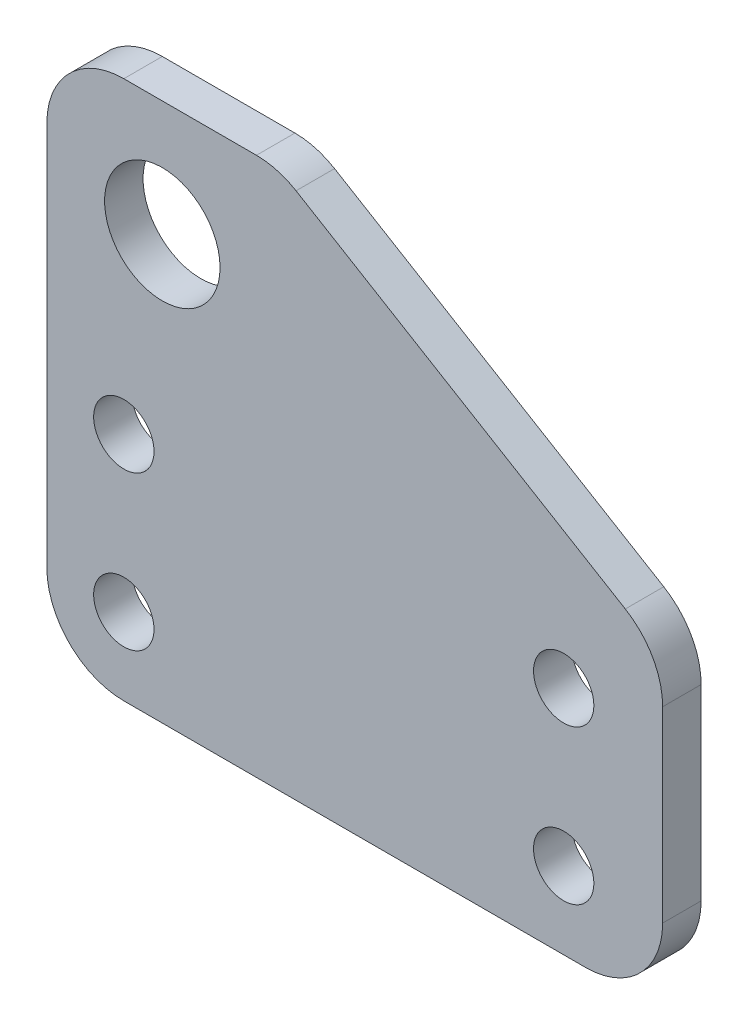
ISO-10303-21;
HEADER;
FILE_DESCRIPTION(('STEP AP214'),'2;1');
FILE_NAME('part.step','',(''),(''),'','','');
FILE_SCHEMA(('AUTOMOTIVE_DESIGN { 1 0 10303 214 1 1 1 1 }'));
ENDSEC;
DATA;
#1=APPLICATION_CONTEXT('core data for automotive mechanical design processes');
#2=APPLICATION_PROTOCOL_DEFINITION('international standard','automotive_design',2000,#1);
#3=PRODUCT_CONTEXT('',#1,'mechanical');
#4=PRODUCT('Part','Part','',(#3));
#5=PRODUCT_RELATED_PRODUCT_CATEGORY('part','',(#4));
#6=PRODUCT_DEFINITION_FORMATION('','',#4);
#7=PRODUCT_DEFINITION_CONTEXT('part definition',#1,'design');
#8=PRODUCT_DEFINITION('design','',#6,#7);
#9=PRODUCT_DEFINITION_SHAPE('','',#8);
#10=(LENGTH_UNIT() NAMED_UNIT(*) SI_UNIT(.MILLI.,.METRE.));
#11=(NAMED_UNIT(*) PLANE_ANGLE_UNIT() SI_UNIT($,.RADIAN.));
#12=(NAMED_UNIT(*) SI_UNIT($,.STERADIAN.) SOLID_ANGLE_UNIT());
#13=UNCERTAINTY_MEASURE_WITH_UNIT(LENGTH_MEASURE(1.E-05),#10,'distance_accuracy_value','');
#14=(GEOMETRIC_REPRESENTATION_CONTEXT(3) GLOBAL_UNCERTAINTY_ASSIGNED_CONTEXT((#13)) GLOBAL_UNIT_ASSIGNED_CONTEXT((#10,
#11,#12)) REPRESENTATION_CONTEXT('',''));
#15=CARTESIAN_POINT('',(0.,0.,0.));
#16=DIRECTION('',(0.,0.,1.));
#17=DIRECTION('',(1.,0.,0.));
#18=AXIS2_PLACEMENT_3D('',#15,#16,#17);
#19=CARTESIAN_POINT('',(0.,0.,3.175));
#20=DIRECTION('',(0.,0.,-1.));
#21=DIRECTION('',(-1.,0.,0.));
#22=AXIS2_PLACEMENT_3D('',#19,#20,#21);
#23=PLANE('',#22);
#24=DIRECTION('',(-1.,0.,0.));
#25=VECTOR('',#24,1.);
#26=CARTESIAN_POINT('',(0.,44.45,3.175));
#27=LINE('',#26,#25);
#28=CARTESIAN_POINT('',(17.2911518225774,44.45,3.175));
#29=VERTEX_POINT('',#28);
#30=CARTESIAN_POINT('',(6.35,44.45,3.175));
#31=VERTEX_POINT('',#30);
#32=EDGE_CURVE('E194',#29,#31,#27,.T.);
#33=ORIENTED_EDGE('',*,*,#32,.T.);
#34=CARTESIAN_POINT('',(6.35,38.1,3.175));
#35=DIRECTION('',(0.,0.,-1.));
#36=DIRECTION('',(-1.,0.,0.));
#37=AXIS2_PLACEMENT_3D('',#34,#35,#36);
#38=CIRCLE('',#37,6.35);
#39=CARTESIAN_POINT('',(0.,38.1,3.175));
#40=VERTEX_POINT('',#39);
#41=EDGE_CURVE('E168',#31,#40,#38,.F.);
#42=ORIENTED_EDGE('',*,*,#41,.T.);
#43=DIRECTION('',(0.,-1.,0.));
#44=VECTOR('',#43,1.);
#45=CARTESIAN_POINT('',(0.,0.,3.175));
#46=LINE('',#45,#44);
#47=CARTESIAN_POINT('',(0.,6.35,3.175));
#48=VERTEX_POINT('',#47);
#49=EDGE_CURVE('E134',#40,#48,#46,.T.);
#50=ORIENTED_EDGE('',*,*,#49,.T.);
#51=CARTESIAN_POINT('',(6.35,6.35,3.175));
#52=DIRECTION('',(0.,0.,-1.));
#53=DIRECTION('',(-1.,0.,0.));
#54=AXIS2_PLACEMENT_3D('',#51,#52,#53);
#55=CIRCLE('',#54,6.35);
#56=CARTESIAN_POINT('',(6.35,0.,3.175));
#57=VERTEX_POINT('',#56);
#58=EDGE_CURVE('E58',#48,#57,#55,.F.);
#59=ORIENTED_EDGE('',*,*,#58,.T.);
#60=DIRECTION('',(1.,0.,0.));
#61=VECTOR('',#60,1.);
#62=CARTESIAN_POINT('',(50.8,0.,3.175));
#63=LINE('',#62,#61);
#64=CARTESIAN_POINT('',(44.45,0.,3.175));
#65=VERTEX_POINT('',#64);
#66=EDGE_CURVE('E150',#57,#65,#63,.T.);
#67=ORIENTED_EDGE('',*,*,#66,.T.);
#68=CARTESIAN_POINT('',(44.45,6.35,3.175));
#69=DIRECTION('',(0.,0.,-1.));
#70=DIRECTION('',(-1.,0.,0.));
#71=AXIS2_PLACEMENT_3D('',#68,#69,#70);
#72=CIRCLE('',#71,6.35);
#73=CARTESIAN_POINT('',(50.8,6.35,3.175));
#74=VERTEX_POINT('',#73);
#75=EDGE_CURVE('E165',#65,#74,#72,.F.);
#76=ORIENTED_EDGE('',*,*,#75,.T.);
#77=DIRECTION('',(0.,1.,0.));
#78=VECTOR('',#77,1.);
#79=CARTESIAN_POINT('',(50.8,0.,3.175));
#80=LINE('',#79,#78);
#81=CARTESIAN_POINT('',(50.8,21.8046910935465,3.175));
#82=VERTEX_POINT('',#81);
#83=EDGE_CURVE('E144',#74,#82,#80,.T.);
#84=ORIENTED_EDGE('',*,*,#83,.T.);
#85=CARTESIAN_POINT('',(44.45,21.8046910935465,3.175));
#86=DIRECTION('',(0.,0.,-1.));
#87=DIRECTION('',(-1.,0.,0.));
#88=AXIS2_PLACEMENT_3D('',#85,#86,#87);
#89=CIRCLE('',#88,6.35);
#90=CARTESIAN_POINT('',(47.7170480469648,27.2497711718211,3.175));
#91=VERTEX_POINT('',#90);
#92=EDGE_CURVE('E163',#82,#91,#89,.F.);
#93=ORIENTED_EDGE('',*,*,#92,.T.);
#94=DIRECTION('',(-0.857492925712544,0.514495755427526,0.));
#95=VECTOR('',#94,1.);
#96=CARTESIAN_POINT('',(50.8,25.4,3.175));
#97=LINE('',#96,#95);
#98=CARTESIAN_POINT('',(20.5581998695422,43.5450800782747,3.175));
#99=VERTEX_POINT('',#98);
#100=EDGE_CURVE('E184',#91,#99,#97,.T.);
#101=ORIENTED_EDGE('',*,*,#100,.T.);
#102=CARTESIAN_POINT('',(17.2911518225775,38.1,3.175));
#103=DIRECTION('',(0.,0.,-1.));
#104=DIRECTION('',(-1.,0.,0.));
#105=AXIS2_PLACEMENT_3D('',#102,#103,#104);
#106=CIRCLE('',#105,6.35);
#107=EDGE_CURVE('E161',#99,#29,#106,.F.);
#108=ORIENTED_EDGE('',*,*,#107,.T.);
#109=EDGE_LOOP('',(#33,#42,#50,#59,#67,#76,#84,#93,#101,#108));
#110=FACE_BOUND('',#109,.T.);
#111=CARTESIAN_POINT('',(6.34999999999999,19.05,3.175));
#112=DIRECTION('',(0.,0.,1.));
#113=DIRECTION('',(1.,0.,0.));
#114=AXIS2_PLACEMENT_3D('',#111,#112,#113);
#115=CIRCLE('',#114,2.4892);
#116=CARTESIAN_POINT('',(8.83919999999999,19.05,3.175));
#117=VERTEX_POINT('',#116);
#118=EDGE_CURVE('E202',#117,#117,#115,.T.);
#119=ORIENTED_EDGE('',*,*,#118,.F.);
#120=EDGE_LOOP('',(#119));
#121=FACE_BOUND('',#120,.T.);
#122=CARTESIAN_POINT('',(42.6357142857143,19.05,3.175));
#123=DIRECTION('',(0.,0.,1.));
#124=DIRECTION('',(1.,0.,0.));
#125=AXIS2_PLACEMENT_3D('',#122,#123,#124);
#126=CIRCLE('',#125,2.4892);
#127=CARTESIAN_POINT('',(45.1249142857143,19.05,3.175));
#128=VERTEX_POINT('',#127);
#129=EDGE_CURVE('E212',#128,#128,#126,.T.);
#130=ORIENTED_EDGE('',*,*,#129,.F.);
#131=EDGE_LOOP('',(#130));
#132=FACE_BOUND('',#131,.T.);
#133=CARTESIAN_POINT('',(42.6357142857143,6.35000000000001,3.175));
#134=DIRECTION('',(0.,0.,1.));
#135=DIRECTION('',(1.,0.,0.));
#136=AXIS2_PLACEMENT_3D('',#133,#134,#135);
#137=CIRCLE('',#136,2.4892);
#138=CARTESIAN_POINT('',(45.1249142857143,6.35000000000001,3.175));
#139=VERTEX_POINT('',#138);
#140=EDGE_CURVE('E218',#139,#139,#137,.T.);
#141=ORIENTED_EDGE('',*,*,#140,.F.);
#142=EDGE_LOOP('',(#141));
#143=FACE_BOUND('',#142,.T.);
#144=CARTESIAN_POINT('',(6.35,6.34999999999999,3.175));
#145=DIRECTION('',(0.,0.,1.));
#146=DIRECTION('',(1.,0.,0.));
#147=AXIS2_PLACEMENT_3D('',#144,#145,#146);
#148=CIRCLE('',#147,2.4892);
#149=CARTESIAN_POINT('',(8.8392,6.34999999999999,3.175));
#150=VERTEX_POINT('',#149);
#151=EDGE_CURVE('E224',#150,#150,#148,.T.);
#152=ORIENTED_EDGE('',*,*,#151,.F.);
#153=EDGE_LOOP('',(#152));
#154=FACE_BOUND('',#153,.T.);
#155=CARTESIAN_POINT('',(9.525,34.925,3.175));
#156=DIRECTION('',(0.,0.,1.));
#157=DIRECTION('',(1.,0.,0.));
#158=AXIS2_PLACEMENT_3D('',#155,#156,#157);
#159=CIRCLE('',#158,4.7625);
#160=CARTESIAN_POINT('',(14.2875,34.925,3.175));
#161=VERTEX_POINT('',#160);
#162=EDGE_CURVE('E230',#161,#161,#159,.T.);
#163=ORIENTED_EDGE('',*,*,#162,.F.);
#164=EDGE_LOOP('',(#163));
#165=FACE_BOUND('',#164,.T.);
#166=ADVANCED_FACE('F36',(#110,#121,#132,#143,#154,#165),#23,.F.);
#167=CARTESIAN_POINT('',(0.,0.,0.));
#168=DIRECTION('',(0.,0.,-1.));
#169=DIRECTION('',(-1.,0.,0.));
#170=AXIS2_PLACEMENT_3D('',#167,#168,#169);
#171=PLANE('',#170);
#172=CARTESIAN_POINT('',(6.35,6.34999999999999,0.));
#173=DIRECTION('',(0.,0.,1.));
#174=DIRECTION('',(1.,0.,0.));
#175=AXIS2_PLACEMENT_3D('',#172,#173,#174);
#176=CIRCLE('',#175,2.4892);
#177=CARTESIAN_POINT('',(8.8392,6.34999999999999,0.));
#178=VERTEX_POINT('',#177);
#179=EDGE_CURVE('E227',#178,#178,#176,.T.);
#180=ORIENTED_EDGE('',*,*,#179,.T.);
#181=EDGE_LOOP('',(#180));
#182=FACE_BOUND('',#181,.T.);
#183=CARTESIAN_POINT('',(42.6357142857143,19.05,0.));
#184=DIRECTION('',(0.,0.,1.));
#185=DIRECTION('',(1.,0.,0.));
#186=AXIS2_PLACEMENT_3D('',#183,#184,#185);
#187=CIRCLE('',#186,2.4892);
#188=CARTESIAN_POINT('',(45.1249142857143,19.05,0.));
#189=VERTEX_POINT('',#188);
#190=EDGE_CURVE('E215',#189,#189,#187,.T.);
#191=ORIENTED_EDGE('',*,*,#190,.T.);
#192=EDGE_LOOP('',(#191));
#193=FACE_BOUND('',#192,.T.);
#194=DIRECTION('',(0.,-1.,0.));
#195=VECTOR('',#194,1.);
#196=CARTESIAN_POINT('',(0.,0.,0.));
#197=LINE('',#196,#195);
#198=CARTESIAN_POINT('',(0.,38.1,0.));
#199=VERTEX_POINT('',#198);
#200=CARTESIAN_POINT('',(0.,6.35,0.));
#201=VERTEX_POINT('',#200);
#202=EDGE_CURVE('E132',#199,#201,#197,.T.);
#203=ORIENTED_EDGE('',*,*,#202,.F.);
#204=CARTESIAN_POINT('',(6.35,38.1,0.));
#205=DIRECTION('',(0.,0.,-1.));
#206=DIRECTION('',(-1.,0.,0.));
#207=AXIS2_PLACEMENT_3D('',#204,#205,#206);
#208=CIRCLE('',#207,6.35);
#209=CARTESIAN_POINT('',(6.35,44.45,0.));
#210=VERTEX_POINT('',#209);
#211=EDGE_CURVE('E115',#199,#210,#208,.T.);
#212=ORIENTED_EDGE('',*,*,#211,.T.);
#213=DIRECTION('',(-1.,0.,0.));
#214=VECTOR('',#213,1.);
#215=CARTESIAN_POINT('',(0.,44.45,0.));
#216=LINE('',#215,#214);
#217=CARTESIAN_POINT('',(17.2911518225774,44.45,0.));
#218=VERTEX_POINT('',#217);
#219=EDGE_CURVE('E142',#218,#210,#216,.T.);
#220=ORIENTED_EDGE('',*,*,#219,.F.);
#221=CARTESIAN_POINT('',(17.2911518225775,38.1,0.));
#222=DIRECTION('',(0.,0.,-1.));
#223=DIRECTION('',(-1.,0.,0.));
#224=AXIS2_PLACEMENT_3D('',#221,#222,#223);
#225=CIRCLE('',#224,6.35);
#226=CARTESIAN_POINT('',(20.5581998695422,43.5450800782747,0.));
#227=VERTEX_POINT('',#226);
#228=EDGE_CURVE('E135',#218,#227,#225,.T.);
#229=ORIENTED_EDGE('',*,*,#228,.T.);
#230=DIRECTION('',(-0.857492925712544,0.514495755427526,0.));
#231=VECTOR('',#230,1.);
#232=CARTESIAN_POINT('',(50.8,25.4,0.));
#233=LINE('',#232,#231);
#234=CARTESIAN_POINT('',(47.7170480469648,27.2497711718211,0.));
#235=VERTEX_POINT('',#234);
#236=EDGE_CURVE('E146',#235,#227,#233,.T.);
#237=ORIENTED_EDGE('',*,*,#236,.F.);
#238=CARTESIAN_POINT('',(44.45,21.8046910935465,0.));
#239=DIRECTION('',(0.,0.,-1.));
#240=DIRECTION('',(-1.,0.,0.));
#241=AXIS2_PLACEMENT_3D('',#238,#239,#240);
#242=CIRCLE('',#241,6.35);
#243=CARTESIAN_POINT('',(50.8,21.8046910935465,0.));
#244=VERTEX_POINT('',#243);
#245=EDGE_CURVE('E153',#235,#244,#242,.T.);
#246=ORIENTED_EDGE('',*,*,#245,.T.);
#247=DIRECTION('',(0.,1.,0.));
#248=VECTOR('',#247,1.);
#249=CARTESIAN_POINT('',(50.8,0.,0.));
#250=LINE('',#249,#248);
#251=CARTESIAN_POINT('',(50.8,6.35,0.));
#252=VERTEX_POINT('',#251);
#253=EDGE_CURVE('E201',#252,#244,#250,.T.);
#254=ORIENTED_EDGE('',*,*,#253,.F.);
#255=CARTESIAN_POINT('',(44.45,6.35,0.));
#256=DIRECTION('',(0.,0.,-1.));
#257=DIRECTION('',(-1.,0.,0.));
#258=AXIS2_PLACEMENT_3D('',#255,#256,#257);
#259=CIRCLE('',#258,6.35);
#260=CARTESIAN_POINT('',(44.45,0.,0.));
#261=VERTEX_POINT('',#260);
#262=EDGE_CURVE('E155',#252,#261,#259,.T.);
#263=ORIENTED_EDGE('',*,*,#262,.T.);
#264=DIRECTION('',(1.,0.,0.));
#265=VECTOR('',#264,1.);
#266=CARTESIAN_POINT('',(50.8,0.,0.));
#267=LINE('',#266,#265);
#268=CARTESIAN_POINT('',(6.35,0.,0.));
#269=VERTEX_POINT('',#268);
#270=EDGE_CURVE('E141',#269,#261,#267,.T.);
#271=ORIENTED_EDGE('',*,*,#270,.F.);
#272=CARTESIAN_POINT('',(6.35,6.35,0.));
#273=DIRECTION('',(0.,0.,-1.));
#274=DIRECTION('',(-1.,0.,0.));
#275=AXIS2_PLACEMENT_3D('',#272,#273,#274);
#276=CIRCLE('',#275,6.35);
#277=EDGE_CURVE('E126',#269,#201,#276,.T.);
#278=ORIENTED_EDGE('',*,*,#277,.T.);
#279=EDGE_LOOP('',(#203,#212,#220,#229,#237,#246,#254,#263,#271,#278));
#280=FACE_BOUND('',#279,.T.);
#281=CARTESIAN_POINT('',(6.34999999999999,19.05,0.));
#282=DIRECTION('',(0.,0.,1.));
#283=DIRECTION('',(1.,0.,0.));
#284=AXIS2_PLACEMENT_3D('',#281,#282,#283);
#285=CIRCLE('',#284,2.4892);
#286=CARTESIAN_POINT('',(8.83919999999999,19.05,0.));
#287=VERTEX_POINT('',#286);
#288=EDGE_CURVE('E209',#287,#287,#285,.T.);
#289=ORIENTED_EDGE('',*,*,#288,.T.);
#290=EDGE_LOOP('',(#289));
#291=FACE_BOUND('',#290,.T.);
#292=CARTESIAN_POINT('',(42.6357142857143,6.35000000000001,0.));
#293=DIRECTION('',(0.,0.,1.));
#294=DIRECTION('',(1.,0.,0.));
#295=AXIS2_PLACEMENT_3D('',#292,#293,#294);
#296=CIRCLE('',#295,2.4892);
#297=CARTESIAN_POINT('',(45.1249142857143,6.35000000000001,0.));
#298=VERTEX_POINT('',#297);
#299=EDGE_CURVE('E221',#298,#298,#296,.T.);
#300=ORIENTED_EDGE('',*,*,#299,.T.);
#301=EDGE_LOOP('',(#300));
#302=FACE_BOUND('',#301,.T.);
#303=CARTESIAN_POINT('',(9.525,34.925,0.));
#304=DIRECTION('',(0.,0.,1.));
#305=DIRECTION('',(1.,0.,0.));
#306=AXIS2_PLACEMENT_3D('',#303,#304,#305);
#307=CIRCLE('',#306,4.7625);
#308=CARTESIAN_POINT('',(14.2875,34.925,0.));
#309=VERTEX_POINT('',#308);
#310=EDGE_CURVE('E233',#309,#309,#307,.T.);
#311=ORIENTED_EDGE('',*,*,#310,.T.);
#312=EDGE_LOOP('',(#311));
#313=FACE_BOUND('',#312,.T.);
#314=ADVANCED_FACE('F138',(#182,#193,#280,#291,#302,#313),#171,.T.);
#315=CARTESIAN_POINT('',(50.8,0.,3.175));
#316=DIRECTION('',(-1.,0.,0.));
#317=DIRECTION('',(0.,-1.,0.));
#318=AXIS2_PLACEMENT_3D('',#315,#316,#317);
#319=PLANE('',#318);
#320=ORIENTED_EDGE('',*,*,#83,.F.);
#321=DIRECTION('',(0.,0.,-1.));
#322=VECTOR('',#321,1.);
#323=CARTESIAN_POINT('',(50.8,6.35,3.175));
#324=LINE('',#323,#322);
#325=EDGE_CURVE('E176',#74,#252,#324,.T.);
#326=ORIENTED_EDGE('',*,*,#325,.T.);
#327=ORIENTED_EDGE('',*,*,#253,.T.);
#328=DIRECTION('',(0.,0.,-1.));
#329=VECTOR('',#328,1.);
#330=CARTESIAN_POINT('',(50.8,21.8046910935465,3.175));
#331=LINE('',#330,#329);
#332=EDGE_CURVE('E174',#244,#82,#331,.F.);
#333=ORIENTED_EDGE('',*,*,#332,.T.);
#334=EDGE_LOOP('',(#320,#326,#327,#333));
#335=FACE_BOUND('',#334,.T.);
#336=ADVANCED_FACE('F247',(#335),#319,.F.);
#337=CARTESIAN_POINT('',(50.8,25.4,3.175));
#338=DIRECTION('',(-0.514495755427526,-0.857492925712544,0.));
#339=DIRECTION('',(0.857492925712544,-0.514495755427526,0.));
#340=AXIS2_PLACEMENT_3D('',#337,#338,#339);
#341=PLANE('',#340);
#342=ORIENTED_EDGE('',*,*,#100,.F.);
#343=DIRECTION('',(0.,0.,-1.));
#344=VECTOR('',#343,1.);
#345=CARTESIAN_POINT('',(47.7170480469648,27.2497711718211,3.175));
#346=LINE('',#345,#344);
#347=EDGE_CURVE('E11',#91,#235,#346,.T.);
#348=ORIENTED_EDGE('',*,*,#347,.T.);
#349=ORIENTED_EDGE('',*,*,#236,.T.);
#350=DIRECTION('',(0.,0.,-1.));
#351=VECTOR('',#350,1.);
#352=CARTESIAN_POINT('',(20.5581998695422,43.5450800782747,3.175));
#353=LINE('',#352,#351);
#354=EDGE_CURVE('E44',#227,#99,#353,.F.);
#355=ORIENTED_EDGE('',*,*,#354,.T.);
#356=EDGE_LOOP('',(#342,#348,#349,#355));
#357=FACE_BOUND('',#356,.T.);
#358=ADVANCED_FACE('F183',(#357),#341,.F.);
#359=CARTESIAN_POINT('',(0.,44.45,3.175));
#360=DIRECTION('',(0.,-1.,0.));
#361=DIRECTION('',(1.,0.,0.));
#362=AXIS2_PLACEMENT_3D('',#359,#360,#361);
#363=PLANE('',#362);
#364=ORIENTED_EDGE('',*,*,#219,.T.);
#365=DIRECTION('',(0.,0.,-1.));
#366=VECTOR('',#365,1.);
#367=CARTESIAN_POINT('',(6.35,44.45,3.175));
#368=LINE('',#367,#366);
#369=EDGE_CURVE('E120',#210,#31,#368,.F.);
#370=ORIENTED_EDGE('',*,*,#369,.T.);
#371=ORIENTED_EDGE('',*,*,#32,.F.);
#372=DIRECTION('',(0.,0.,-1.));
#373=VECTOR('',#372,1.);
#374=CARTESIAN_POINT('',(17.2911518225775,44.45,3.175));
#375=LINE('',#374,#373);
#376=EDGE_CURVE('E125',#29,#218,#375,.T.);
#377=ORIENTED_EDGE('',*,*,#376,.T.);
#378=EDGE_LOOP('',(#364,#370,#371,#377));
#379=FACE_BOUND('',#378,.T.);
#380=ADVANCED_FACE('F198',(#379),#363,.F.);
#381=CARTESIAN_POINT('',(0.,0.,3.175));
#382=DIRECTION('',(1.,0.,0.));
#383=DIRECTION('',(0.,0.,-1.));
#384=AXIS2_PLACEMENT_3D('',#381,#382,#383);
#385=PLANE('',#384);
#386=ORIENTED_EDGE('',*,*,#49,.F.);
#387=DIRECTION('',(0.,0.,-1.));
#388=VECTOR('',#387,1.);
#389=CARTESIAN_POINT('',(0.,38.1,3.175));
#390=LINE('',#389,#388);
#391=EDGE_CURVE('E119',#40,#199,#390,.T.);
#392=ORIENTED_EDGE('',*,*,#391,.T.);
#393=ORIENTED_EDGE('',*,*,#202,.T.);
#394=DIRECTION('',(0.,0.,-1.));
#395=VECTOR('',#394,1.);
#396=CARTESIAN_POINT('',(0.,6.35,3.175));
#397=LINE('',#396,#395);
#398=EDGE_CURVE('E136',#201,#48,#397,.F.);
#399=ORIENTED_EDGE('',*,*,#398,.T.);
#400=EDGE_LOOP('',(#386,#392,#393,#399));
#401=FACE_BOUND('',#400,.T.);
#402=ADVANCED_FACE('F131',(#401),#385,.F.);
#403=CARTESIAN_POINT('',(50.8,0.,3.175));
#404=DIRECTION('',(0.,1.,0.));
#405=DIRECTION('',(-1.,0.,0.));
#406=AXIS2_PLACEMENT_3D('',#403,#404,#405);
#407=PLANE('',#406);
#408=ORIENTED_EDGE('',*,*,#66,.F.);
#409=DIRECTION('',(0.,0.,-1.));
#410=VECTOR('',#409,1.);
#411=CARTESIAN_POINT('',(6.35,0.,3.175));
#412=LINE('',#411,#410);
#413=EDGE_CURVE('E171',#57,#269,#412,.T.);
#414=ORIENTED_EDGE('',*,*,#413,.T.);
#415=ORIENTED_EDGE('',*,*,#270,.T.);
#416=DIRECTION('',(0.,0.,-1.));
#417=VECTOR('',#416,1.);
#418=CARTESIAN_POINT('',(44.45,0.,3.175));
#419=LINE('',#418,#417);
#420=EDGE_CURVE('E51',#261,#65,#419,.F.);
#421=ORIENTED_EDGE('',*,*,#420,.T.);
#422=EDGE_LOOP('',(#408,#414,#415,#421));
#423=FACE_BOUND('',#422,.T.);
#424=ADVANCED_FACE('F254',(#423),#407,.F.);
#425=CARTESIAN_POINT('',(6.34999999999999,19.05,3.175));
#426=DIRECTION('',(0.,0.,-1.));
#427=DIRECTION('',(-1.,0.,0.));
#428=AXIS2_PLACEMENT_3D('',#425,#426,#427);
#429=CYLINDRICAL_SURFACE('',#428,2.4892);
#430=ORIENTED_EDGE('',*,*,#118,.T.);
#431=EDGE_LOOP('',(#430));
#432=FACE_BOUND('',#431,.T.);
#433=ORIENTED_EDGE('',*,*,#288,.F.);
#434=EDGE_LOOP('',(#433));
#435=FACE_BOUND('',#434,.T.);
#436=ADVANCED_FACE('F251',(#432,#435),#429,.F.);
#437=CARTESIAN_POINT('',(42.6357142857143,19.05,3.175));
#438=DIRECTION('',(0.,0.,-1.));
#439=DIRECTION('',(-1.,0.,0.));
#440=AXIS2_PLACEMENT_3D('',#437,#438,#439);
#441=CYLINDRICAL_SURFACE('',#440,2.4892);
#442=ORIENTED_EDGE('',*,*,#129,.T.);
#443=EDGE_LOOP('',(#442));
#444=FACE_BOUND('',#443,.T.);
#445=ORIENTED_EDGE('',*,*,#190,.F.);
#446=EDGE_LOOP('',(#445));
#447=FACE_BOUND('',#446,.T.);
#448=ADVANCED_FACE('F380',(#444,#447),#441,.F.);
#449=CARTESIAN_POINT('',(42.6357142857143,6.35000000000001,3.175));
#450=DIRECTION('',(0.,0.,-1.));
#451=DIRECTION('',(-1.,0.,0.));
#452=AXIS2_PLACEMENT_3D('',#449,#450,#451);
#453=CYLINDRICAL_SURFACE('',#452,2.4892);
#454=ORIENTED_EDGE('',*,*,#140,.T.);
#455=EDGE_LOOP('',(#454));
#456=FACE_BOUND('',#455,.T.);
#457=ORIENTED_EDGE('',*,*,#299,.F.);
#458=EDGE_LOOP('',(#457));
#459=FACE_BOUND('',#458,.T.);
#460=ADVANCED_FACE('F370',(#456,#459),#453,.F.);
#461=CARTESIAN_POINT('',(6.35,6.34999999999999,3.175));
#462=DIRECTION('',(0.,0.,-1.));
#463=DIRECTION('',(-1.,0.,0.));
#464=AXIS2_PLACEMENT_3D('',#461,#462,#463);
#465=CYLINDRICAL_SURFACE('',#464,2.4892);
#466=ORIENTED_EDGE('',*,*,#151,.T.);
#467=EDGE_LOOP('',(#466));
#468=FACE_BOUND('',#467,.T.);
#469=ORIENTED_EDGE('',*,*,#179,.F.);
#470=EDGE_LOOP('',(#469));
#471=FACE_BOUND('',#470,.T.);
#472=ADVANCED_FACE('F361',(#468,#471),#465,.F.);
#473=CARTESIAN_POINT('',(9.525,34.925,3.175));
#474=DIRECTION('',(0.,0.,-1.));
#475=DIRECTION('',(-1.,0.,0.));
#476=AXIS2_PLACEMENT_3D('',#473,#474,#475);
#477=CYLINDRICAL_SURFACE('',#476,4.7625);
#478=ORIENTED_EDGE('',*,*,#162,.T.);
#479=EDGE_LOOP('',(#478));
#480=FACE_BOUND('',#479,.T.);
#481=ORIENTED_EDGE('',*,*,#310,.F.);
#482=EDGE_LOOP('',(#481));
#483=FACE_BOUND('',#482,.T.);
#484=ADVANCED_FACE('F239',(#480,#483),#477,.F.);
#485=CARTESIAN_POINT('',(6.35,38.1,3.175));
#486=DIRECTION('',(0.,0.,-1.));
#487=DIRECTION('',(-1.,0.,0.));
#488=AXIS2_PLACEMENT_3D('',#485,#486,#487);
#489=CYLINDRICAL_SURFACE('',#488,6.35);
#490=ORIENTED_EDGE('',*,*,#41,.F.);
#491=ORIENTED_EDGE('',*,*,#369,.F.);
#492=ORIENTED_EDGE('',*,*,#211,.F.);
#493=ORIENTED_EDGE('',*,*,#391,.F.);
#494=EDGE_LOOP('',(#490,#491,#492,#493));
#495=FACE_BOUND('',#494,.T.);
#496=ADVANCED_FACE('F118',(#495),#489,.T.);
#497=CARTESIAN_POINT('',(6.35,6.35,3.175));
#498=DIRECTION('',(0.,0.,-1.));
#499=DIRECTION('',(-1.,0.,0.));
#500=AXIS2_PLACEMENT_3D('',#497,#498,#499);
#501=CYLINDRICAL_SURFACE('',#500,6.35);
#502=ORIENTED_EDGE('',*,*,#58,.F.);
#503=ORIENTED_EDGE('',*,*,#398,.F.);
#504=ORIENTED_EDGE('',*,*,#277,.F.);
#505=ORIENTED_EDGE('',*,*,#413,.F.);
#506=EDGE_LOOP('',(#502,#503,#504,#505));
#507=FACE_BOUND('',#506,.T.);
#508=ADVANCED_FACE('F268',(#507),#501,.T.);
#509=CARTESIAN_POINT('',(44.45,6.35,3.175));
#510=DIRECTION('',(0.,0.,-1.));
#511=DIRECTION('',(-1.,0.,0.));
#512=AXIS2_PLACEMENT_3D('',#509,#510,#511);
#513=CYLINDRICAL_SURFACE('',#512,6.35);
#514=ORIENTED_EDGE('',*,*,#75,.F.);
#515=ORIENTED_EDGE('',*,*,#420,.F.);
#516=ORIENTED_EDGE('',*,*,#262,.F.);
#517=ORIENTED_EDGE('',*,*,#325,.F.);
#518=EDGE_LOOP('',(#514,#515,#516,#517));
#519=FACE_BOUND('',#518,.T.);
#520=ADVANCED_FACE('F271',(#519),#513,.T.);
#521=CARTESIAN_POINT('',(44.45,21.8046910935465,3.175));
#522=DIRECTION('',(0.,0.,-1.));
#523=DIRECTION('',(-1.,0.,0.));
#524=AXIS2_PLACEMENT_3D('',#521,#522,#523);
#525=CYLINDRICAL_SURFACE('',#524,6.35);
#526=ORIENTED_EDGE('',*,*,#92,.F.);
#527=ORIENTED_EDGE('',*,*,#332,.F.);
#528=ORIENTED_EDGE('',*,*,#245,.F.);
#529=ORIENTED_EDGE('',*,*,#347,.F.);
#530=EDGE_LOOP('',(#526,#527,#528,#529));
#531=FACE_BOUND('',#530,.T.);
#532=ADVANCED_FACE('F274',(#531),#525,.T.);
#533=CARTESIAN_POINT('',(17.2911518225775,38.1,3.175));
#534=DIRECTION('',(0.,0.,-1.));
#535=DIRECTION('',(-1.,0.,0.));
#536=AXIS2_PLACEMENT_3D('',#533,#534,#535);
#537=CYLINDRICAL_SURFACE('',#536,6.35);
#538=ORIENTED_EDGE('',*,*,#107,.F.);
#539=ORIENTED_EDGE('',*,*,#354,.F.);
#540=ORIENTED_EDGE('',*,*,#228,.F.);
#541=ORIENTED_EDGE('',*,*,#376,.F.);
#542=EDGE_LOOP('',(#538,#539,#540,#541));
#543=FACE_BOUND('',#542,.T.);
#544=ADVANCED_FACE('F38',(#543),#537,.T.);
#545=CLOSED_SHELL('',(#166,#314,#336,#358,#380,#402,#424,#436,#448,#460,#472,#484,#496,#508,
#520,#532,#544));
#546=MANIFOLD_SOLID_BREP('B2',#545);
#547=ADVANCED_BREP_SHAPE_REPRESENTATION('',(#18,#546),#14);
#548=SHAPE_DEFINITION_REPRESENTATION(#9,#547);
ENDSEC;
END-ISO-10303-21;
